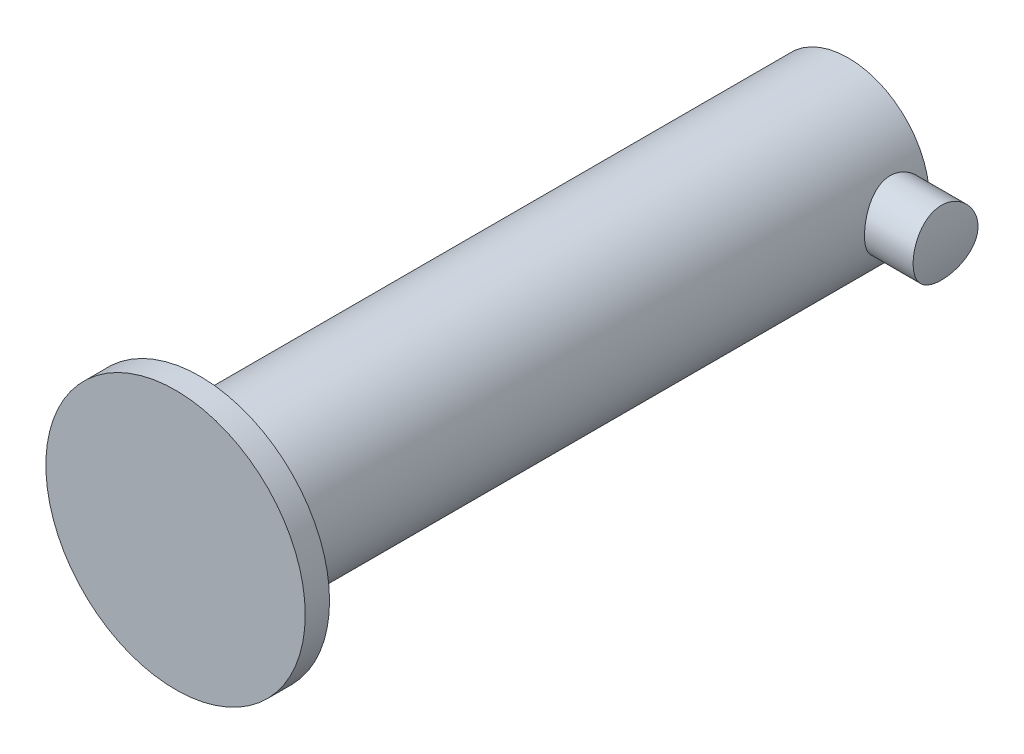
ISO-10303-21;
HEADER;
FILE_DESCRIPTION(('STEP AP214'),'2;1');
FILE_NAME('part.step','',(''),(''),'','','');
FILE_SCHEMA(('AUTOMOTIVE_DESIGN { 1 0 10303 214 1 1 1 1 }'));
ENDSEC;
DATA;
#1=APPLICATION_CONTEXT('core data for automotive mechanical design processes');
#2=APPLICATION_PROTOCOL_DEFINITION('international standard','automotive_design',2000,#1);
#3=PRODUCT_CONTEXT('',#1,'mechanical');
#4=PRODUCT('Part','Part','',(#3));
#5=PRODUCT_RELATED_PRODUCT_CATEGORY('part','',(#4));
#6=PRODUCT_DEFINITION_FORMATION('','',#4);
#7=PRODUCT_DEFINITION_CONTEXT('part definition',#1,'design');
#8=PRODUCT_DEFINITION('design','',#6,#7);
#9=PRODUCT_DEFINITION_SHAPE('','',#8);
#10=(LENGTH_UNIT() NAMED_UNIT(*) SI_UNIT(.MILLI.,.METRE.));
#11=(NAMED_UNIT(*) PLANE_ANGLE_UNIT() SI_UNIT($,.RADIAN.));
#12=(NAMED_UNIT(*) SI_UNIT($,.STERADIAN.) SOLID_ANGLE_UNIT());
#13=UNCERTAINTY_MEASURE_WITH_UNIT(LENGTH_MEASURE(1.E-05),#10,'distance_accuracy_value','');
#14=(GEOMETRIC_REPRESENTATION_CONTEXT(3) GLOBAL_UNCERTAINTY_ASSIGNED_CONTEXT((#13)) GLOBAL_UNIT_ASSIGNED_CONTEXT((#10,
#11,#12)) REPRESENTATION_CONTEXT('',''));
#15=CARTESIAN_POINT('',(0.,0.,0.));
#16=DIRECTION('',(0.,0.,1.));
#17=DIRECTION('',(1.,0.,0.));
#18=AXIS2_PLACEMENT_3D('',#15,#16,#17);
#19=CARTESIAN_POINT('',(1.6,0.,0.4));
#20=DIRECTION('',(-1.,0.,0.));
#21=DIRECTION('',(0.,0.,1.));
#22=AXIS2_PLACEMENT_3D('',#19,#20,#21);
#23=CYLINDRICAL_SURFACE('',#22,0.4);
#24=CARTESIAN_POINT('',(1.,0.,0.));
#25=CARTESIAN_POINT('',(0.99999854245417,0.0214986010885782,1.97036474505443E-06));
#26=CARTESIAN_POINT('',(0.999298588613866,0.0430345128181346,0.00174355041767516));
#27=CARTESIAN_POINT('',(0.996566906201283,0.0854992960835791,0.00864954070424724));
#28=CARTESIAN_POINT('',(0.994531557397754,0.10642635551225,0.0138232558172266));
#29=CARTESIAN_POINT('',(0.989348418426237,0.146990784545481,0.0273752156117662));
#30=CARTESIAN_POINT('',(0.986204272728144,0.166632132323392,0.0357429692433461));
#31=CARTESIAN_POINT('',(0.979113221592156,0.204214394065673,0.0554038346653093));
#32=CARTESIAN_POINT('',(0.975166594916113,0.222155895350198,0.0666959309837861));
#33=CARTESIAN_POINT('',(0.966661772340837,0.256700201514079,0.0924470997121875));
#34=CARTESIAN_POINT('',(0.962084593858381,0.273212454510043,0.107021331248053));
#35=CARTESIAN_POINT('',(0.952921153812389,0.303635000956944,0.138680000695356));
#36=CARTESIAN_POINT('',(0.948334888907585,0.317544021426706,0.155765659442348));
#37=CARTESIAN_POINT('',(0.939445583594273,0.342974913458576,0.192885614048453));
#38=CARTESIAN_POINT('',(0.935164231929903,0.354362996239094,0.21301729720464));
#39=CARTESIAN_POINT('',(0.927667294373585,0.37355094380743,0.255107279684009));
#40=CARTESIAN_POINT('',(0.924451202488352,0.381352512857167,0.277064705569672));
#41=CARTESIAN_POINT('',(0.919652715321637,0.392779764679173,0.321142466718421));
#42=CARTESIAN_POINT('',(0.91800284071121,0.396578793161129,0.343210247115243));
#43=CARTESIAN_POINT('',(0.916328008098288,0.400434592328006,0.387726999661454));
#44=CARTESIAN_POINT('',(0.916302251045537,0.400493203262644,0.410175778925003));
#45=CARTESIAN_POINT('',(0.917821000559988,0.396997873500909,0.453151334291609));
#46=CARTESIAN_POINT('',(0.9192563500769,0.393695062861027,0.473703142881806));
#47=CARTESIAN_POINT('',(0.923352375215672,0.383989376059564,0.513931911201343));
#48=CARTESIAN_POINT('',(0.926013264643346,0.377585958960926,0.533608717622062));
#49=CARTESIAN_POINT('',(0.932318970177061,0.361738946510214,0.572003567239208));
#50=CARTESIAN_POINT('',(0.935982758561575,0.352235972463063,0.590693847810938));
#51=CARTESIAN_POINT('',(0.94387623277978,0.330501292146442,0.626283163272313));
#52=CARTESIAN_POINT('',(0.948106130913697,0.318268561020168,0.643181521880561));
#53=CARTESIAN_POINT('',(0.957053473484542,0.290310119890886,0.6760819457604));
#54=CARTESIAN_POINT('',(0.961783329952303,0.274387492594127,0.691913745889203));
#55=CARTESIAN_POINT('',(0.970919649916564,0.240062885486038,0.720736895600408));
#56=CARTESIAN_POINT('',(0.975326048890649,0.221660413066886,0.733727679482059));
#57=CARTESIAN_POINT('',(0.983429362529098,0.182415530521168,0.756723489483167));
#58=CARTESIAN_POINT('',(0.987110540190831,0.161532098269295,0.76666445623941));
#59=CARTESIAN_POINT('',(0.993229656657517,0.118204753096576,0.782833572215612));
#60=CARTESIAN_POINT('',(0.99566822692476,0.0957616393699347,0.789063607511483));
#61=CARTESIAN_POINT('',(0.998912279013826,0.0513791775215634,0.79728965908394));
#62=CARTESIAN_POINT('',(0.999805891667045,0.0294886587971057,0.79951449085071));
#63=CARTESIAN_POINT('',(1.00013695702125,-0.0143690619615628,0.800342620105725));
#64=CARTESIAN_POINT('',(0.99957478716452,-0.0363362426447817,0.798946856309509));
#65=CARTESIAN_POINT('',(0.997115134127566,-0.078686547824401,0.792741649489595));
#66=CARTESIAN_POINT('',(0.995278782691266,-0.099096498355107,0.788088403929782));
#67=CARTESIAN_POINT('',(0.990518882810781,-0.138827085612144,0.77571285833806));
#68=CARTESIAN_POINT('',(0.987595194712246,-0.158147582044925,0.76799016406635));
#69=CARTESIAN_POINT('',(0.980833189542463,-0.195815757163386,0.749443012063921));
#70=CARTESIAN_POINT('',(0.976969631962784,-0.214115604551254,0.738530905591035));
#71=CARTESIAN_POINT('',(0.968746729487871,-0.248688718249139,0.714011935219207));
#72=CARTESIAN_POINT('',(0.964387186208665,-0.264961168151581,0.700403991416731));
#73=CARTESIAN_POINT('',(0.955290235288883,-0.296144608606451,0.669825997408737));
#74=CARTESIAN_POINT('',(0.950546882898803,-0.310894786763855,0.652693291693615));
#75=CARTESIAN_POINT('',(0.941483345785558,-0.3373502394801,0.61611198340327));
#76=CARTESIAN_POINT('',(0.937163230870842,-0.349055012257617,0.59666299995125));
#77=CARTESIAN_POINT('',(0.929428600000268,-0.369161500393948,0.555707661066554));
#78=CARTESIAN_POINT('',(0.926023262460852,-0.377530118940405,0.534183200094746));
#79=CARTESIAN_POINT('',(0.920647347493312,-0.390459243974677,0.48985326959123));
#80=CARTESIAN_POINT('',(0.91867571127,-0.395022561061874,0.467048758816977));
#81=CARTESIAN_POINT('',(0.916543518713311,-0.399943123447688,0.422574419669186));
#82=CARTESIAN_POINT('',(0.916262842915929,-0.400579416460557,0.400941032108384));
#83=CARTESIAN_POINT('',(0.917229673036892,-0.398360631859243,0.357891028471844));
#84=CARTESIAN_POINT('',(0.918476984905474,-0.395505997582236,0.336474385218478));
#85=CARTESIAN_POINT('',(0.92225329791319,-0.386614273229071,0.295333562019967));
#86=CARTESIAN_POINT('',(0.92472966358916,-0.38070749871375,0.275575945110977));
#87=CARTESIAN_POINT('',(0.93064800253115,-0.366001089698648,0.237324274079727));
#88=CARTESIAN_POINT('',(0.93409024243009,-0.357200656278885,0.218830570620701));
#89=CARTESIAN_POINT('',(0.941797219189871,-0.336374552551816,0.18247807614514));
#90=CARTESIAN_POINT('',(0.946097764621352,-0.324193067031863,0.164716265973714));
#91=CARTESIAN_POINT('',(0.954927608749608,-0.297178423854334,0.131401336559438));
#92=CARTESIAN_POINT('',(0.959456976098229,-0.282344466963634,0.115848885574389));
#93=CARTESIAN_POINT('',(0.968587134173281,-0.249301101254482,0.0863594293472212));
#94=CARTESIAN_POINT('',(0.973173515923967,-0.230935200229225,0.0725925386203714));
#95=CARTESIAN_POINT('',(0.981600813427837,-0.191980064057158,0.0483325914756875));
#96=CARTESIAN_POINT('',(0.985441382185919,-0.171389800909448,0.0378410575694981));
#97=CARTESIAN_POINT('',(0.991879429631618,-0.12894761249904,0.0206755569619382));
#98=CARTESIAN_POINT('',(0.994498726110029,-0.107126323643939,0.0139341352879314));
#99=CARTESIAN_POINT('',(0.998288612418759,-0.062575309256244,0.00427217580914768));
#100=CARTESIAN_POINT('',(0.999463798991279,-0.0398487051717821,0.00133951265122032));
#101=CARTESIAN_POINT('',(0.999951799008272,-0.0113824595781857,0.000120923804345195));
#102=CARTESIAN_POINT('',(1.00000038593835,-0.00569253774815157,-5.21725838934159E-07));
#103=CARTESIAN_POINT('',(1.,0.,0.));
#104=B_SPLINE_CURVE_WITH_KNOTS('',3,(#24,#25,#26,#27,#28,#29,#30,#31,#32,#33,#34,#35,#36,#37,
#38,#39,#40,#41,#42,#43,#44,#45,#46,#47,#48,#49,#50,#51,#52,#53,#54,#55,#56,#57,#58,#59,#60,#61,
#62,#63,#64,#65,#66,#67,#68,#69,#70,#71,#72,#73,#74,#75,#76,#77,#78,#79,#80,#81,#82,#83,#84,#85,
#86,#87,#88,#89,#90,#91,#92,#93,#94,#95,#96,#97,#98,#99,#100,#101,#102,#103),.UNSPECIFIED.,.T.,
.F.,(4,2,2,2,2,2,2,2,2,2,2,2,2,2,2,2,2,2,2,2,2,2,2,2,2,2,2,2,2,2,2,2,2,2,2,2,2,2,2,4),(0.,
0.0644805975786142,0.129136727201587,0.193582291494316,0.258005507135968,0.325194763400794,
0.392416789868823,0.462630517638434,0.532810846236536,0.599808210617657,0.666772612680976,
0.729076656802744,0.791391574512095,0.854978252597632,0.918588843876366,0.987116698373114,
1.05565818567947,1.12555382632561,1.19541391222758,1.26113836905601,1.32684578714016,
1.38960091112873,1.45236409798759,1.51704702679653,1.58175591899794,1.65073694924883,
1.7197293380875,1.7893900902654,1.85899934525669,1.92359934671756,1.98819114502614,
2.05022863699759,2.11228327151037,2.17789093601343,2.24351840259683,2.31340084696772,
2.38331572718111,2.45192860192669,2.52032250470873,2.53739609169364),.UNSPECIFIED.);
#105=CARTESIAN_POINT('',(1.,0.,0.));
#106=VERTEX_POINT('',#105);
#107=EDGE_CURVE('E55',#106,#106,#104,.T.);
#108=ORIENTED_EDGE('',*,*,#107,.T.);
#109=EDGE_LOOP('',(#108));
#110=FACE_BOUND('',#109,.T.);
#111=CARTESIAN_POINT('',(1.6,0.,0.8));
#112=CARTESIAN_POINT('',(1.5999996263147,-0.0221002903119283,0.799999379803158));
#113=CARTESIAN_POINT('',(1.59953754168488,-0.0442075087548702,0.79816225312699));
#114=CARTESIAN_POINT('',(1.59773897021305,-0.0877883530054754,0.790873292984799));
#115=CARTESIAN_POINT('',(1.59640198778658,-0.109261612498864,0.785419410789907));
#116=CARTESIAN_POINT('',(1.59300167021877,-0.150938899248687,0.771082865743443));
#117=CARTESIAN_POINT('',(1.5909392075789,-0.171144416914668,0.762204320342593));
#118=CARTESIAN_POINT('',(1.58630758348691,-0.209779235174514,0.741284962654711));
#119=CARTESIAN_POINT('',(1.58373840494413,-0.228208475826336,0.729244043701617));
#120=CARTESIAN_POINT('',(1.57831310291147,-0.263147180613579,0.702079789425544));
#121=CARTESIAN_POINT('',(1.57545255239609,-0.279614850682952,0.686903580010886));
#122=CARTESIAN_POINT('',(1.56979632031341,-0.309799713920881,0.654012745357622));
#123=CARTESIAN_POINT('',(1.56700064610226,-0.323516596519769,0.636297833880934));
#124=CARTESIAN_POINT('',(1.56174606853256,-0.348007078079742,0.598507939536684));
#125=CARTESIAN_POINT('',(1.55929278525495,-0.358733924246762,0.578401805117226));
#126=CARTESIAN_POINT('',(1.55506531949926,-0.376639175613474,0.536600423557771));
#127=CARTESIAN_POINT('',(1.55329102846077,-0.383818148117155,0.51490543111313));
#128=CARTESIAN_POINT('',(1.55066793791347,-0.394281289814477,0.471001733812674));
#129=CARTESIAN_POINT('',(1.54980130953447,-0.39764060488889,0.448812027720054));
#130=CARTESIAN_POINT('',(1.54903830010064,-0.400603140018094,0.404168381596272));
#131=CARTESIAN_POINT('',(1.54914176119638,-0.400206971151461,0.381714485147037));
#132=CARTESIAN_POINT('',(1.55029121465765,-0.395729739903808,0.337755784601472));
#133=CARTESIAN_POINT('',(1.55131430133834,-0.391738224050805,0.316241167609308));
#134=CARTESIAN_POINT('',(1.55415122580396,-0.380326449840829,0.274197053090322));
#135=CARTESIAN_POINT('',(1.55596511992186,-0.372905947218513,0.253667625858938));
#136=CARTESIAN_POINT('',(1.5602003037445,-0.354770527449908,0.213936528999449));
#137=CARTESIAN_POINT('',(1.56262753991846,-0.34402311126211,0.194750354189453));
#138=CARTESIAN_POINT('',(1.56781256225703,-0.319561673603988,0.158421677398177));
#139=CARTESIAN_POINT('',(1.57057040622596,-0.305847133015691,0.141279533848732));
#140=CARTESIAN_POINT('',(1.57620234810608,-0.275376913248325,0.10901236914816));
#141=CARTESIAN_POINT('',(1.57907751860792,-0.258545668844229,0.0939588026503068));
#142=CARTESIAN_POINT('',(1.58454924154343,-0.222563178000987,0.0668743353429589));
#143=CARTESIAN_POINT('',(1.58714578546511,-0.203411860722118,0.0548435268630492));
#144=CARTESIAN_POINT('',(1.59178061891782,-0.163230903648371,0.0341198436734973));
#145=CARTESIAN_POINT('',(1.5938169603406,-0.142195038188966,0.0254385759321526));
#146=CARTESIAN_POINT('',(1.59708777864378,-0.0989002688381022,0.011755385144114));
#147=CARTESIAN_POINT('',(1.59832240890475,-0.0766415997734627,0.00675275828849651));
#148=CARTESIAN_POINT('',(1.599827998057,-0.0321439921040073,0.000677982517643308));
#149=CARTESIAN_POINT('',(1.60012280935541,-0.00991912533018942,-0.000491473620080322));
#150=CARTESIAN_POINT('',(1.5997834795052,0.0344087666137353,0.000866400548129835));
#151=CARTESIAN_POINT('',(1.59914942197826,0.0565118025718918,0.00339339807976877));
#152=CARTESIAN_POINT('',(1.59703888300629,0.0996304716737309,0.0119922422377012));
#153=CARTESIAN_POINT('',(1.5955750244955,0.120657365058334,0.0180110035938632));
#154=CARTESIAN_POINT('',(1.59196988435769,0.161401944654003,0.0333618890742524));
#155=CARTESIAN_POINT('',(1.58982853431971,0.181119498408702,0.0426943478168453));
#156=CARTESIAN_POINT('',(1.58504882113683,0.219072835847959,0.0645963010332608));
#157=CARTESIAN_POINT('',(1.58240231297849,0.237276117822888,0.0772202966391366));
#158=CARTESIAN_POINT('',(1.57691869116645,0.271340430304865,0.105277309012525));
#159=CARTESIAN_POINT('',(1.57408154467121,0.287201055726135,0.120710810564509));
#160=CARTESIAN_POINT('',(1.56845055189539,0.316530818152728,0.154400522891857));
#161=CARTESIAN_POINT('',(1.56565947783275,0.329931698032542,0.172716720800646));
#162=CARTESIAN_POINT('',(1.5605143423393,0.353469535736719,0.211395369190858));
#163=CARTESIAN_POINT('',(1.55816026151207,0.363606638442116,0.231757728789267));
#164=CARTESIAN_POINT('',(1.55418158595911,0.380253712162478,0.273841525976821));
#165=CARTESIAN_POINT('',(1.55255268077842,0.386785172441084,0.295554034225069));
#166=CARTESIAN_POINT('',(1.55020465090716,0.396092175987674,0.339815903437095));
#167=CARTESIAN_POINT('',(1.54948532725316,0.398868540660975,0.362365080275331));
#168=CARTESIAN_POINT('',(1.54905306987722,0.400543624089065,0.406965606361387));
#169=CARTESIAN_POINT('',(1.5493118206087,0.399551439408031,0.429012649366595));
#170=CARTESIAN_POINT('',(1.55074109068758,0.393967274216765,0.472614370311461));
#171=CARTESIAN_POINT('',(1.55191159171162,0.389375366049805,0.494169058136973));
#172=CARTESIAN_POINT('',(1.55501669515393,0.376781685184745,0.536055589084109));
#173=CARTESIAN_POINT('',(1.55694670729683,0.368800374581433,0.556393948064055));
#174=CARTESIAN_POINT('',(1.56135401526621,0.349670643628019,0.595457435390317));
#175=CARTESIAN_POINT('',(1.56383138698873,0.338521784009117,0.614182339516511));
#176=CARTESIAN_POINT('',(1.5691350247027,0.31303139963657,0.650014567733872));
#177=CARTESIAN_POINT('',(1.57196870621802,0.298614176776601,0.667066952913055));
#178=CARTESIAN_POINT('',(1.5776214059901,0.267143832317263,0.698545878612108));
#179=CARTESIAN_POINT('',(1.58044042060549,0.250090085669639,0.712971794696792));
#180=CARTESIAN_POINT('',(1.5858070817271,0.213458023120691,0.739043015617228));
#181=CARTESIAN_POINT('',(1.58834888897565,0.19383957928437,0.750633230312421));
#182=CARTESIAN_POINT('',(1.59281313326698,0.152870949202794,0.770332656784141));
#183=CARTESIAN_POINT('',(1.59473601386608,0.131522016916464,0.778444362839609));
#184=CARTESIAN_POINT('',(1.59746149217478,0.0918427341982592,0.789752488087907));
#185=CARTESIAN_POINT('',(1.59840689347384,0.0737013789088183,0.793586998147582));
#186=CARTESIAN_POINT('',(1.59967628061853,0.0370416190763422,0.798710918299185));
#187=CARTESIAN_POINT('',(1.60000031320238,0.018523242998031,0.800000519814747));
#188=CARTESIAN_POINT('',(1.6,0.,0.8));
#189=B_SPLINE_CURVE_WITH_KNOTS('',3,(#111,#112,#113,#114,#115,#116,#117,#118,#119,#120,#121,
#122,#123,#124,#125,#126,#127,#128,#129,#130,#131,#132,#133,#134,#135,#136,#137,#138,#139,#140,
#141,#142,#143,#144,#145,#146,#147,#148,#149,#150,#151,#152,#153,#154,#155,#156,#157,#158,#159,
#160,#161,#162,#163,#164,#165,#166,#167,#168,#169,#170,#171,#172,#173,#174,#175,#176,#177,#178,
#179,#180,#181,#182,#183,#184,#185,#186,#187,#188),.UNSPECIFIED.,.T.,.F.,(4,2,2,2,2,2,2,2,2,2,2,
2,2,2,2,2,2,2,2,2,2,2,2,2,2,2,2,2,2,2,2,2,2,2,2,2,2,2,4),(0.,0.0662329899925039,
0.132503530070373,0.198694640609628,0.264887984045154,0.332305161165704,0.399729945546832,
0.468156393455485,0.536571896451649,0.603616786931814,0.670650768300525,0.736059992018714,
0.801473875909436,0.867548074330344,0.933633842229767,1.00160400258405,1.06957623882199,
1.1377819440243,1.20597459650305,1.27242215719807,1.33886373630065,1.40432073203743,
1.46978433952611,1.53640956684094,1.60304630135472,1.67131869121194,1.73958804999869,
1.8074460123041,1.87528912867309,1.9411834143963,2.00707637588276,2.07257706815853,
2.13808684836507,2.20530553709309,2.27254018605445,2.34099249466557,2.40939563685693,
2.46491264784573,2.52042548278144),.UNSPECIFIED.);
#190=CARTESIAN_POINT('',(1.6,0.,0.8));
#191=VERTEX_POINT('',#190);
#192=EDGE_CURVE('E63',#191,#191,#189,.T.);
#193=ORIENTED_EDGE('',*,*,#192,.F.);
#194=EDGE_LOOP('',(#193));
#195=FACE_BOUND('',#194,.T.);
#196=ADVANCED_FACE('F33',(#110,#195),#23,.T.);
#197=CARTESIAN_POINT('',(0.,0.,8.));
#198=DIRECTION('',(0.,0.,-1.));
#199=DIRECTION('',(-1.,0.,0.));
#200=AXIS2_PLACEMENT_3D('',#197,#198,#199);
#201=CYLINDRICAL_SURFACE('',#200,1.);
#202=CARTESIAN_POINT('',(0.,0.,8.));
#203=DIRECTION('',(0.,0.,1.));
#204=DIRECTION('',(1.,0.,0.));
#205=AXIS2_PLACEMENT_3D('',#202,#203,#204);
#206=CIRCLE('',#205,1.);
#207=CARTESIAN_POINT('',(1.,0.,8.));
#208=VERTEX_POINT('',#207);
#209=EDGE_CURVE('E11',#208,#208,#206,.T.);
#210=ORIENTED_EDGE('',*,*,#209,.F.);
#211=EDGE_LOOP('',(#210));
#212=FACE_BOUND('',#211,.T.);
#213=CARTESIAN_POINT('',(0.,0.,0.));
#214=DIRECTION('',(0.,0.,1.));
#215=DIRECTION('',(1.,0.,0.));
#216=AXIS2_PLACEMENT_3D('',#213,#214,#215);
#217=CIRCLE('',#216,1.);
#218=EDGE_CURVE('E38',#106,#106,#217,.T.);
#219=ORIENTED_EDGE('',*,*,#218,.T.);
#220=ORIENTED_EDGE('',*,*,#107,.F.);
#221=EDGE_LOOP('',(#219,#220));
#222=FACE_BOUND('',#221,.T.);
#223=ADVANCED_FACE('F35',(#212,#222),#201,.T.);
#224=CARTESIAN_POINT('',(0.,0.,0.));
#225=DIRECTION('',(0.,0.,1.));
#226=DIRECTION('',(1.,0.,0.));
#227=AXIS2_PLACEMENT_3D('',#224,#225,#226);
#228=PLANE('',#227);
#229=CARTESIAN_POINT('',(0.,0.,0.));
#230=DIRECTION('',(0.,0.,-1.));
#231=DIRECTION('',(-1.,0.,0.));
#232=AXIS2_PLACEMENT_3D('',#229,#230,#231);
#233=CIRCLE('',#232,0.7);
#234=CARTESIAN_POINT('',(-0.7,0.,0.));
#235=VERTEX_POINT('',#234);
#236=EDGE_CURVE('E94',#235,#235,#233,.T.);
#237=ORIENTED_EDGE('',*,*,#236,.F.);
#238=EDGE_LOOP('',(#237));
#239=FACE_BOUND('',#238,.T.);
#240=ORIENTED_EDGE('',*,*,#218,.F.);
#241=EDGE_LOOP('',(#240));
#242=FACE_BOUND('',#241,.T.);
#243=ADVANCED_FACE('F45',(#239,#242),#228,.F.);
#244=CARTESIAN_POINT('',(0.,0.,8.3));
#245=DIRECTION('',(0.,0.,-1.));
#246=DIRECTION('',(-1.,0.,0.));
#247=AXIS2_PLACEMENT_3D('',#244,#245,#246);
#248=CYLINDRICAL_SURFACE('',#247,1.6);
#249=CARTESIAN_POINT('',(0.,0.,8.3));
#250=DIRECTION('',(0.,0.,1.));
#251=DIRECTION('',(1.,0.,0.));
#252=AXIS2_PLACEMENT_3D('',#249,#250,#251);
#253=CIRCLE('',#252,1.6);
#254=CARTESIAN_POINT('',(1.6,0.,8.3));
#255=VERTEX_POINT('',#254);
#256=EDGE_CURVE('E48',#255,#255,#253,.T.);
#257=ORIENTED_EDGE('',*,*,#256,.F.);
#258=EDGE_LOOP('',(#257));
#259=FACE_BOUND('',#258,.T.);
#260=CARTESIAN_POINT('',(0.,0.,8.));
#261=DIRECTION('',(0.,0.,1.));
#262=DIRECTION('',(1.,0.,0.));
#263=AXIS2_PLACEMENT_3D('',#260,#261,#262);
#264=CIRCLE('',#263,1.6);
#265=CARTESIAN_POINT('',(1.6,0.,8.));
#266=VERTEX_POINT('',#265);
#267=EDGE_CURVE('E50',#266,#266,#264,.T.);
#268=ORIENTED_EDGE('',*,*,#267,.T.);
#269=EDGE_LOOP('',(#268));
#270=FACE_BOUND('',#269,.T.);
#271=ADVANCED_FACE('F80',(#259,#270),#248,.T.);
#272=CARTESIAN_POINT('',(0.,0.,8.3));
#273=DIRECTION('',(0.,0.,1.));
#274=DIRECTION('',(1.,0.,0.));
#275=AXIS2_PLACEMENT_3D('',#272,#273,#274);
#276=PLANE('',#275);
#277=ORIENTED_EDGE('',*,*,#256,.T.);
#278=EDGE_LOOP('',(#277));
#279=FACE_BOUND('',#278,.T.);
#280=ADVANCED_FACE('F75',(#279),#276,.T.);
#281=CARTESIAN_POINT('',(0.,0.,8.));
#282=DIRECTION('',(0.,0.,1.));
#283=DIRECTION('',(1.,0.,0.));
#284=AXIS2_PLACEMENT_3D('',#281,#282,#283);
#285=PLANE('',#284);
#286=ORIENTED_EDGE('',*,*,#209,.T.);
#287=EDGE_LOOP('',(#286));
#288=FACE_BOUND('',#287,.T.);
#289=ORIENTED_EDGE('',*,*,#267,.F.);
#290=EDGE_LOOP('',(#289));
#291=FACE_BOUND('',#290,.T.);
#292=ADVANCED_FACE('F79',(#288,#291),#285,.F.);
#293=CARTESIAN_POINT('',(0.,0.,1.6));
#294=DIRECTION('',(0.,0.,-1.));
#295=DIRECTION('',(-1.,0.,0.));
#296=AXIS2_PLACEMENT_3D('',#293,#294,#295);
#297=CYLINDRICAL_SURFACE('',#296,1.6);
#298=ORIENTED_EDGE('',*,*,#192,.T.);
#299=EDGE_LOOP('',(#298));
#300=FACE_BOUND('',#299,.T.);
#301=ADVANCED_FACE('F72',(#300),#297,.T.);
#302=CARTESIAN_POINT('',(0.,0.,8.));
#303=DIRECTION('',(0.,0.,1.));
#304=DIRECTION('',(1.,0.,0.));
#305=AXIS2_PLACEMENT_3D('',#302,#303,#304);
#306=PLANE('',#305);
#307=CARTESIAN_POINT('',(0.,0.,8.));
#308=DIRECTION('',(0.,0.,1.));
#309=DIRECTION('',(1.,0.,0.));
#310=AXIS2_PLACEMENT_3D('',#307,#308,#309);
#311=CIRCLE('',#310,0.7);
#312=CARTESIAN_POINT('',(0.7,0.,8.));
#313=VERTEX_POINT('',#312);
#314=EDGE_CURVE('E96',#313,#313,#311,.F.);
#315=ORIENTED_EDGE('',*,*,#314,.T.);
#316=EDGE_LOOP('',(#315));
#317=FACE_BOUND('',#316,.T.);
#318=ADVANCED_FACE('F106',(#317),#306,.F.);
#319=CARTESIAN_POINT('',(0.,0.,9.97989898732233));
#320=DIRECTION('',(0.,0.,-1.));
#321=DIRECTION('',(-1.,0.,0.));
#322=AXIS2_PLACEMENT_3D('',#319,#320,#321);
#323=CYLINDRICAL_SURFACE('',#322,0.7);
#324=ORIENTED_EDGE('',*,*,#236,.T.);
#325=EDGE_LOOP('',(#324));
#326=FACE_BOUND('',#325,.T.);
#327=ORIENTED_EDGE('',*,*,#314,.F.);
#328=EDGE_LOOP('',(#327));
#329=FACE_BOUND('',#328,.T.);
#330=ADVANCED_FACE('F110',(#326,#329),#323,.F.);
#331=CLOSED_SHELL('',(#196,#223,#243,#271,#280,#292,#301,#318,#330));
#332=MANIFOLD_SOLID_BREP('B2',#331);
#333=ADVANCED_BREP_SHAPE_REPRESENTATION('',(#18,#332),#14);
#334=SHAPE_DEFINITION_REPRESENTATION(#9,#333);
ENDSEC;
END-ISO-10303-21;
